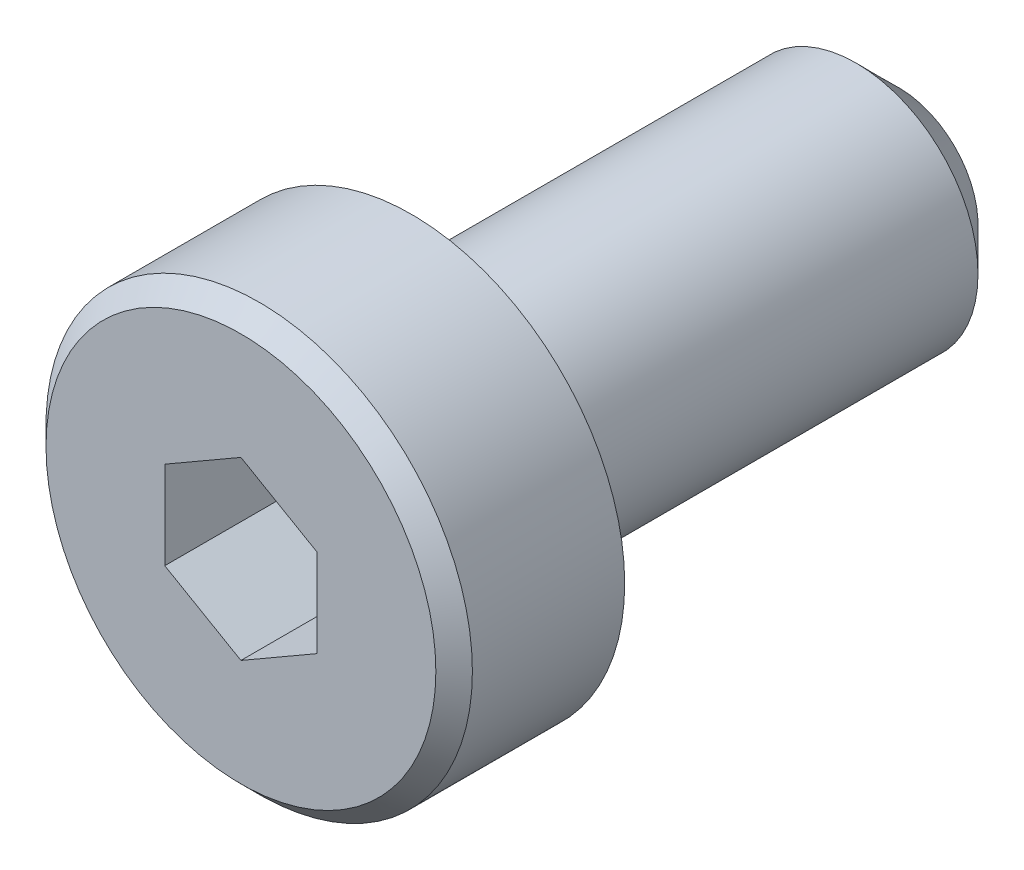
ISO-10303-21;
HEADER;
FILE_DESCRIPTION(('STEP AP214'),'2;1');
FILE_NAME('part.step','',(''),(''),'','','');
FILE_SCHEMA(('AUTOMOTIVE_DESIGN { 1 0 10303 214 1 1 1 1 }'));
ENDSEC;
DATA;
#1=APPLICATION_CONTEXT('core data for automotive mechanical design processes');
#2=APPLICATION_PROTOCOL_DEFINITION('international standard','automotive_design',2000,#1);
#3=PRODUCT_CONTEXT('',#1,'mechanical');
#4=PRODUCT('Part','Part','',(#3));
#5=PRODUCT_RELATED_PRODUCT_CATEGORY('part','',(#4));
#6=PRODUCT_DEFINITION_FORMATION('','',#4);
#7=PRODUCT_DEFINITION_CONTEXT('part definition',#1,'design');
#8=PRODUCT_DEFINITION('design','',#6,#7);
#9=PRODUCT_DEFINITION_SHAPE('','',#8);
#10=(LENGTH_UNIT() NAMED_UNIT(*) SI_UNIT(.MILLI.,.METRE.));
#11=(NAMED_UNIT(*) PLANE_ANGLE_UNIT() SI_UNIT($,.RADIAN.));
#12=(NAMED_UNIT(*) SI_UNIT($,.STERADIAN.) SOLID_ANGLE_UNIT());
#13=UNCERTAINTY_MEASURE_WITH_UNIT(LENGTH_MEASURE(1.E-05),#10,'distance_accuracy_value','');
#14=(GEOMETRIC_REPRESENTATION_CONTEXT(3) GLOBAL_UNCERTAINTY_ASSIGNED_CONTEXT((#13)) GLOBAL_UNIT_ASSIGNED_CONTEXT((#10,
#11,#12)) REPRESENTATION_CONTEXT('',''));
#15=CARTESIAN_POINT('',(0.,0.,0.));
#16=DIRECTION('',(0.,0.,1.));
#17=DIRECTION('',(1.,0.,0.));
#18=AXIS2_PLACEMENT_3D('',#15,#16,#17);
#19=CARTESIAN_POINT('',(0.,0.,12.));
#20=DIRECTION('',(0.,0.,1.));
#21=DIRECTION('',(1.,0.,0.));
#22=AXIS2_PLACEMENT_3D('',#19,#20,#21);
#23=CYLINDRICAL_SURFACE('',#22,3.5);
#24=CARTESIAN_POINT('',(0.,0.,2.5));
#25=DIRECTION('',(0.,0.,1.));
#26=DIRECTION('',(1.,0.,0.));
#27=AXIS2_PLACEMENT_3D('',#24,#25,#26);
#28=CIRCLE('',#27,3.5);
#29=CARTESIAN_POINT('',(3.5,0.,2.5));
#30=VERTEX_POINT('',#29);
#31=EDGE_CURVE('E130',#30,#30,#28,.F.);
#32=ORIENTED_EDGE('',*,*,#31,.T.);
#33=EDGE_LOOP('',(#32));
#34=FACE_BOUND('',#33,.T.);
#35=CARTESIAN_POINT('',(0.,0.,0.));
#36=DIRECTION('',(0.,0.,1.));
#37=DIRECTION('',(1.,0.,0.));
#38=AXIS2_PLACEMENT_3D('',#35,#36,#37);
#39=CIRCLE('',#38,3.5);
#40=CARTESIAN_POINT('',(3.5,0.,0.));
#41=VERTEX_POINT('',#40);
#42=EDGE_CURVE('E124',#41,#41,#39,.T.);
#43=ORIENTED_EDGE('',*,*,#42,.T.);
#44=EDGE_LOOP('',(#43));
#45=FACE_BOUND('',#44,.T.);
#46=ADVANCED_FACE('F14',(#34,#45),#23,.T.);
#47=CARTESIAN_POINT('',(3.5,0.,0.));
#48=DIRECTION('',(0.,0.,-1.));
#49=DIRECTION('',(-1.,0.,0.));
#50=AXIS2_PLACEMENT_3D('',#47,#48,#49);
#51=PLANE('',#50);
#52=CARTESIAN_POINT('',(0.,0.,0.));
#53=DIRECTION('',(0.,0.,1.));
#54=DIRECTION('',(1.,0.,0.));
#55=AXIS2_PLACEMENT_3D('',#52,#53,#54);
#56=CIRCLE('',#55,2.);
#57=CARTESIAN_POINT('',(2.,0.,0.));
#58=VERTEX_POINT('',#57);
#59=EDGE_CURVE('E116',#58,#58,#56,.T.);
#60=ORIENTED_EDGE('',*,*,#59,.T.);
#61=EDGE_LOOP('',(#60));
#62=FACE_BOUND('',#61,.T.);
#63=ORIENTED_EDGE('',*,*,#42,.F.);
#64=EDGE_LOOP('',(#63));
#65=FACE_BOUND('',#64,.T.);
#66=ADVANCED_FACE('F149',(#62,#65),#51,.T.);
#67=CARTESIAN_POINT('',(0.,0.,12.));
#68=DIRECTION('',(0.,0.,1.));
#69=DIRECTION('',(1.,0.,0.));
#70=AXIS2_PLACEMENT_3D('',#67,#68,#69);
#71=CYLINDRICAL_SURFACE('',#70,2.);
#72=CARTESIAN_POINT('',(0.,0.,-7.3));
#73=DIRECTION('',(0.,0.,-1.));
#74=DIRECTION('',(-1.,0.,0.));
#75=AXIS2_PLACEMENT_3D('',#72,#73,#74);
#76=CIRCLE('',#75,2.);
#77=CARTESIAN_POINT('',(-2.,0.,-7.3));
#78=VERTEX_POINT('',#77);
#79=EDGE_CURVE('E22',#78,#78,#76,.F.);
#80=ORIENTED_EDGE('',*,*,#79,.T.);
#81=EDGE_LOOP('',(#80));
#82=FACE_BOUND('',#81,.T.);
#83=ORIENTED_EDGE('',*,*,#59,.F.);
#84=EDGE_LOOP('',(#83));
#85=FACE_BOUND('',#84,.T.);
#86=ADVANCED_FACE('F135',(#82,#85),#71,.T.);
#87=CARTESIAN_POINT('',(2.,0.,-8.));
#88=DIRECTION('',(0.,0.,-1.));
#89=DIRECTION('',(-1.,0.,0.));
#90=AXIS2_PLACEMENT_3D('',#87,#88,#89);
#91=PLANE('',#90);
#92=CARTESIAN_POINT('',(0.,0.,-8.));
#93=DIRECTION('',(0.,0.,-1.));
#94=DIRECTION('',(-1.,0.,0.));
#95=AXIS2_PLACEMENT_3D('',#92,#93,#94);
#96=CIRCLE('',#95,1.3);
#97=CARTESIAN_POINT('',(-1.3,0.,-8.));
#98=VERTEX_POINT('',#97);
#99=EDGE_CURVE('E9',#98,#98,#96,.T.);
#100=ORIENTED_EDGE('',*,*,#99,.T.);
#101=EDGE_LOOP('',(#100));
#102=FACE_BOUND('',#101,.T.);
#103=ADVANCED_FACE('F162',(#102),#91,.T.);
#104=CARTESIAN_POINT('',(0.,0.,2.8));
#105=DIRECTION('',(0.,0.,1.));
#106=DIRECTION('',(1.,0.,0.));
#107=AXIS2_PLACEMENT_3D('',#104,#105,#106);
#108=PLANE('',#107);
#109=CARTESIAN_POINT('',(0.,0.,2.8));
#110=DIRECTION('',(0.,0.,1.));
#111=DIRECTION('',(1.,0.,0.));
#112=AXIS2_PLACEMENT_3D('',#109,#110,#111);
#113=CIRCLE('',#112,3.2);
#114=CARTESIAN_POINT('',(3.2,0.,2.8));
#115=VERTEX_POINT('',#114);
#116=EDGE_CURVE('E127',#115,#115,#113,.T.);
#117=ORIENTED_EDGE('',*,*,#116,.T.);
#118=EDGE_LOOP('',(#117));
#119=FACE_BOUND('',#118,.T.);
#120=DIRECTION('',(-0.866025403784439,0.5,0.));
#121=VECTOR('',#120,1.);
#122=CARTESIAN_POINT('',(1.25,0.721687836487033,2.8));
#123=LINE('',#122,#121);
#124=CARTESIAN_POINT('',(1.25,0.721687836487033,2.8));
#125=VERTEX_POINT('',#124);
#126=CARTESIAN_POINT('',(0.,1.44337567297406,2.8));
#127=VERTEX_POINT('',#126);
#128=EDGE_CURVE('E29',#125,#127,#123,.T.);
#129=ORIENTED_EDGE('',*,*,#128,.F.);
#130=DIRECTION('',(0.,1.,0.));
#131=VECTOR('',#130,1.);
#132=CARTESIAN_POINT('',(1.25,-0.721687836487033,2.8));
#133=LINE('',#132,#131);
#134=CARTESIAN_POINT('',(1.25,-0.721687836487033,2.8));
#135=VERTEX_POINT('',#134);
#136=EDGE_CURVE('E112',#135,#125,#133,.T.);
#137=ORIENTED_EDGE('',*,*,#136,.F.);
#138=DIRECTION('',(0.866025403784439,0.5,0.));
#139=VECTOR('',#138,1.);
#140=CARTESIAN_POINT('',(0.,-1.44337567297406,2.8));
#141=LINE('',#140,#139);
#142=CARTESIAN_POINT('',(0.,-1.44337567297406,2.8));
#143=VERTEX_POINT('',#142);
#144=EDGE_CURVE('E110',#143,#135,#141,.T.);
#145=ORIENTED_EDGE('',*,*,#144,.F.);
#146=DIRECTION('',(0.866025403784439,-0.5,0.));
#147=VECTOR('',#146,1.);
#148=CARTESIAN_POINT('',(-1.25,-0.721687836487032,2.8));
#149=LINE('',#148,#147);
#150=CARTESIAN_POINT('',(-1.25,-0.721687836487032,2.8));
#151=VERTEX_POINT('',#150);
#152=EDGE_CURVE('E77',#151,#143,#149,.T.);
#153=ORIENTED_EDGE('',*,*,#152,.F.);
#154=DIRECTION('',(0.,-1.,0.));
#155=VECTOR('',#154,1.);
#156=CARTESIAN_POINT('',(-1.25,0.721687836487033,2.8));
#157=LINE('',#156,#155);
#158=CARTESIAN_POINT('',(-1.25,0.721687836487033,2.8));
#159=VERTEX_POINT('',#158);
#160=EDGE_CURVE('E106',#159,#151,#157,.T.);
#161=ORIENTED_EDGE('',*,*,#160,.F.);
#162=DIRECTION('',(-0.866025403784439,-0.5,0.));
#163=VECTOR('',#162,1.);
#164=CARTESIAN_POINT('',(0.,1.44337567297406,2.8));
#165=LINE('',#164,#163);
#166=EDGE_CURVE('E103',#127,#159,#165,.T.);
#167=ORIENTED_EDGE('',*,*,#166,.F.);
#168=EDGE_LOOP('',(#129,#137,#145,#153,#161,#167));
#169=FACE_BOUND('',#168,.T.);
#170=ADVANCED_FACE('F165',(#119,#169),#108,.T.);
#171=CARTESIAN_POINT('',(1.25,0.721687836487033,0.5));
#172=DIRECTION('',(0.5,0.866025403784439,0.));
#173=DIRECTION('',(-0.866025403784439,0.5,0.));
#174=AXIS2_PLACEMENT_3D('',#171,#172,#173);
#175=PLANE('',#174);
#176=ORIENTED_EDGE('',*,*,#128,.T.);
#177=DIRECTION('',(0.,0.,1.));
#178=VECTOR('',#177,1.);
#179=CARTESIAN_POINT('',(0.,1.44337567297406,0.5));
#180=LINE('',#179,#178);
#181=CARTESIAN_POINT('',(0.,1.44337567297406,0.5));
#182=VERTEX_POINT('',#181);
#183=EDGE_CURVE('E59',#182,#127,#180,.T.);
#184=ORIENTED_EDGE('',*,*,#183,.F.);
#185=DIRECTION('',(-0.866025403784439,0.5,0.));
#186=VECTOR('',#185,1.);
#187=CARTESIAN_POINT('',(1.25,0.721687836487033,0.5));
#188=LINE('',#187,#186);
#189=CARTESIAN_POINT('',(1.25,0.721687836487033,0.5));
#190=VERTEX_POINT('',#189);
#191=EDGE_CURVE('E114',#190,#182,#188,.T.);
#192=ORIENTED_EDGE('',*,*,#191,.F.);
#193=DIRECTION('',(0.,0.,1.));
#194=VECTOR('',#193,1.);
#195=CARTESIAN_POINT('',(1.25,0.721687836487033,0.5));
#196=LINE('',#195,#194);
#197=EDGE_CURVE('E37',#190,#125,#196,.T.);
#198=ORIENTED_EDGE('',*,*,#197,.T.);
#199=EDGE_LOOP('',(#176,#184,#192,#198));
#200=FACE_BOUND('',#199,.T.);
#201=ADVANCED_FACE('F169',(#200),#175,.F.);
#202=CARTESIAN_POINT('',(1.25,-0.721687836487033,0.5));
#203=DIRECTION('',(1.,0.,0.));
#204=DIRECTION('',(0.,1.,0.));
#205=AXIS2_PLACEMENT_3D('',#202,#203,#204);
#206=PLANE('',#205);
#207=ORIENTED_EDGE('',*,*,#136,.T.);
#208=ORIENTED_EDGE('',*,*,#197,.F.);
#209=DIRECTION('',(0.,1.,0.));
#210=VECTOR('',#209,1.);
#211=CARTESIAN_POINT('',(1.25,-0.721687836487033,0.5));
#212=LINE('',#211,#210);
#213=CARTESIAN_POINT('',(1.25,-0.721687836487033,0.5));
#214=VERTEX_POINT('',#213);
#215=EDGE_CURVE('E89',#214,#190,#212,.T.);
#216=ORIENTED_EDGE('',*,*,#215,.F.);
#217=DIRECTION('',(0.,0.,1.));
#218=VECTOR('',#217,1.);
#219=CARTESIAN_POINT('',(1.25,-0.721687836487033,0.5));
#220=LINE('',#219,#218);
#221=EDGE_CURVE('E81',#214,#135,#220,.T.);
#222=ORIENTED_EDGE('',*,*,#221,.T.);
#223=EDGE_LOOP('',(#207,#208,#216,#222));
#224=FACE_BOUND('',#223,.T.);
#225=ADVANCED_FACE('F173',(#224),#206,.F.);
#226=CARTESIAN_POINT('',(0.,-1.44337567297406,0.5));
#227=DIRECTION('',(0.5,-0.866025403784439,0.));
#228=DIRECTION('',(0.866025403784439,0.5,0.));
#229=AXIS2_PLACEMENT_3D('',#226,#227,#228);
#230=PLANE('',#229);
#231=ORIENTED_EDGE('',*,*,#144,.T.);
#232=ORIENTED_EDGE('',*,*,#221,.F.);
#233=DIRECTION('',(0.866025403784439,0.5,0.));
#234=VECTOR('',#233,1.);
#235=CARTESIAN_POINT('',(0.,-1.44337567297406,0.5));
#236=LINE('',#235,#234);
#237=CARTESIAN_POINT('',(0.,-1.44337567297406,0.5));
#238=VERTEX_POINT('',#237);
#239=EDGE_CURVE('E85',#238,#214,#236,.T.);
#240=ORIENTED_EDGE('',*,*,#239,.F.);
#241=DIRECTION('',(0.,0.,1.));
#242=VECTOR('',#241,1.);
#243=CARTESIAN_POINT('',(0.,-1.44337567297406,0.5));
#244=LINE('',#243,#242);
#245=EDGE_CURVE('E70',#238,#143,#244,.T.);
#246=ORIENTED_EDGE('',*,*,#245,.T.);
#247=EDGE_LOOP('',(#231,#232,#240,#246));
#248=FACE_BOUND('',#247,.T.);
#249=ADVANCED_FACE('F86',(#248),#230,.F.);
#250=CARTESIAN_POINT('',(-1.25,-0.721687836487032,0.5));
#251=DIRECTION('',(-0.5,-0.866025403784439,0.));
#252=DIRECTION('',(0.866025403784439,-0.5,0.));
#253=AXIS2_PLACEMENT_3D('',#250,#251,#252);
#254=PLANE('',#253);
#255=ORIENTED_EDGE('',*,*,#152,.T.);
#256=ORIENTED_EDGE('',*,*,#245,.F.);
#257=DIRECTION('',(0.866025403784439,-0.5,0.));
#258=VECTOR('',#257,1.);
#259=CARTESIAN_POINT('',(-1.25,-0.721687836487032,0.5));
#260=LINE('',#259,#258);
#261=CARTESIAN_POINT('',(-1.25,-0.721687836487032,0.5));
#262=VERTEX_POINT('',#261);
#263=EDGE_CURVE('E74',#262,#238,#260,.T.);
#264=ORIENTED_EDGE('',*,*,#263,.F.);
#265=DIRECTION('',(0.,0.,1.));
#266=VECTOR('',#265,1.);
#267=CARTESIAN_POINT('',(-1.25,-0.721687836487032,0.5));
#268=LINE('',#267,#266);
#269=EDGE_CURVE('E82',#262,#151,#268,.T.);
#270=ORIENTED_EDGE('',*,*,#269,.T.);
#271=EDGE_LOOP('',(#255,#256,#264,#270));
#272=FACE_BOUND('',#271,.T.);
#273=ADVANCED_FACE('F72',(#272),#254,.F.);
#274=CARTESIAN_POINT('',(-1.25,0.721687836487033,0.5));
#275=DIRECTION('',(-1.,0.,0.));
#276=DIRECTION('',(0.,0.,1.));
#277=AXIS2_PLACEMENT_3D('',#274,#275,#276);
#278=PLANE('',#277);
#279=ORIENTED_EDGE('',*,*,#160,.T.);
#280=ORIENTED_EDGE('',*,*,#269,.F.);
#281=DIRECTION('',(0.,-1.,0.));
#282=VECTOR('',#281,1.);
#283=CARTESIAN_POINT('',(-1.25,0.721687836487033,0.5));
#284=LINE('',#283,#282);
#285=CARTESIAN_POINT('',(-1.25,0.721687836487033,0.5));
#286=VERTEX_POINT('',#285);
#287=EDGE_CURVE('E95',#286,#262,#284,.T.);
#288=ORIENTED_EDGE('',*,*,#287,.F.);
#289=DIRECTION('',(0.,0.,1.));
#290=VECTOR('',#289,1.);
#291=CARTESIAN_POINT('',(-1.25,0.721687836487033,0.5));
#292=LINE('',#291,#290);
#293=EDGE_CURVE('E119',#286,#159,#292,.T.);
#294=ORIENTED_EDGE('',*,*,#293,.T.);
#295=EDGE_LOOP('',(#279,#280,#288,#294));
#296=FACE_BOUND('',#295,.T.);
#297=ADVANCED_FACE('F177',(#296),#278,.F.);
#298=CARTESIAN_POINT('',(0.,1.44337567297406,0.5));
#299=DIRECTION('',(-0.5,0.866025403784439,0.));
#300=DIRECTION('',(-0.866025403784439,-0.5,0.));
#301=AXIS2_PLACEMENT_3D('',#298,#299,#300);
#302=PLANE('',#301);
#303=ORIENTED_EDGE('',*,*,#166,.T.);
#304=ORIENTED_EDGE('',*,*,#293,.F.);
#305=DIRECTION('',(-0.866025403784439,-0.5,0.));
#306=VECTOR('',#305,1.);
#307=CARTESIAN_POINT('',(0.,1.44337567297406,0.5));
#308=LINE('',#307,#306);
#309=EDGE_CURVE('E97',#182,#286,#308,.T.);
#310=ORIENTED_EDGE('',*,*,#309,.F.);
#311=ORIENTED_EDGE('',*,*,#183,.T.);
#312=EDGE_LOOP('',(#303,#304,#310,#311));
#313=FACE_BOUND('',#312,.T.);
#314=ADVANCED_FACE('F174',(#313),#302,.F.);
#315=CARTESIAN_POINT('',(0.,0.,0.5));
#316=DIRECTION('',(0.,0.,1.));
#317=DIRECTION('',(1.,0.,0.));
#318=AXIS2_PLACEMENT_3D('',#315,#316,#317);
#319=PLANE('',#318);
#320=ORIENTED_EDGE('',*,*,#191,.T.);
#321=ORIENTED_EDGE('',*,*,#309,.T.);
#322=ORIENTED_EDGE('',*,*,#287,.T.);
#323=ORIENTED_EDGE('',*,*,#263,.T.);
#324=ORIENTED_EDGE('',*,*,#239,.T.);
#325=ORIENTED_EDGE('',*,*,#215,.T.);
#326=EDGE_LOOP('',(#320,#321,#322,#323,#324,#325));
#327=FACE_BOUND('',#326,.T.);
#328=ADVANCED_FACE('F92',(#327),#319,.T.);
#329=CARTESIAN_POINT('',(0.,0.,2.8));
#330=DIRECTION('',(0.,0.,-1.));
#331=DIRECTION('',(-1.,0.,0.));
#332=AXIS2_PLACEMENT_3D('',#329,#330,#331);
#333=CONICAL_SURFACE('',#332,3.2,0.785398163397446);
#334=ORIENTED_EDGE('',*,*,#31,.F.);
#335=EDGE_LOOP('',(#334));
#336=FACE_BOUND('',#335,.T.);
#337=ORIENTED_EDGE('',*,*,#116,.F.);
#338=EDGE_LOOP('',(#337));
#339=FACE_BOUND('',#338,.T.);
#340=ADVANCED_FACE('F139',(#336,#339),#333,.T.);
#341=CARTESIAN_POINT('',(0.,0.,-7.3));
#342=DIRECTION('',(0.,0.,1.));
#343=DIRECTION('',(1.,0.,0.));
#344=AXIS2_PLACEMENT_3D('',#341,#342,#343);
#345=CONICAL_SURFACE('',#344,2.,0.785398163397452);
#346=ORIENTED_EDGE('',*,*,#99,.F.);
#347=EDGE_LOOP('',(#346));
#348=FACE_BOUND('',#347,.T.);
#349=ORIENTED_EDGE('',*,*,#79,.F.);
#350=EDGE_LOOP('',(#349));
#351=FACE_BOUND('',#350,.T.);
#352=ADVANCED_FACE('F16',(#348,#351),#345,.T.);
#353=CLOSED_SHELL('',(#46,#66,#86,#103,#170,#201,#225,#249,#273,#297,#314,#328,#340,#352));
#354=MANIFOLD_SOLID_BREP('B1',#353);
#355=ADVANCED_BREP_SHAPE_REPRESENTATION('',(#18,#354),#14);
#356=SHAPE_DEFINITION_REPRESENTATION(#9,#355);
ENDSEC;
END-ISO-10303-21;
